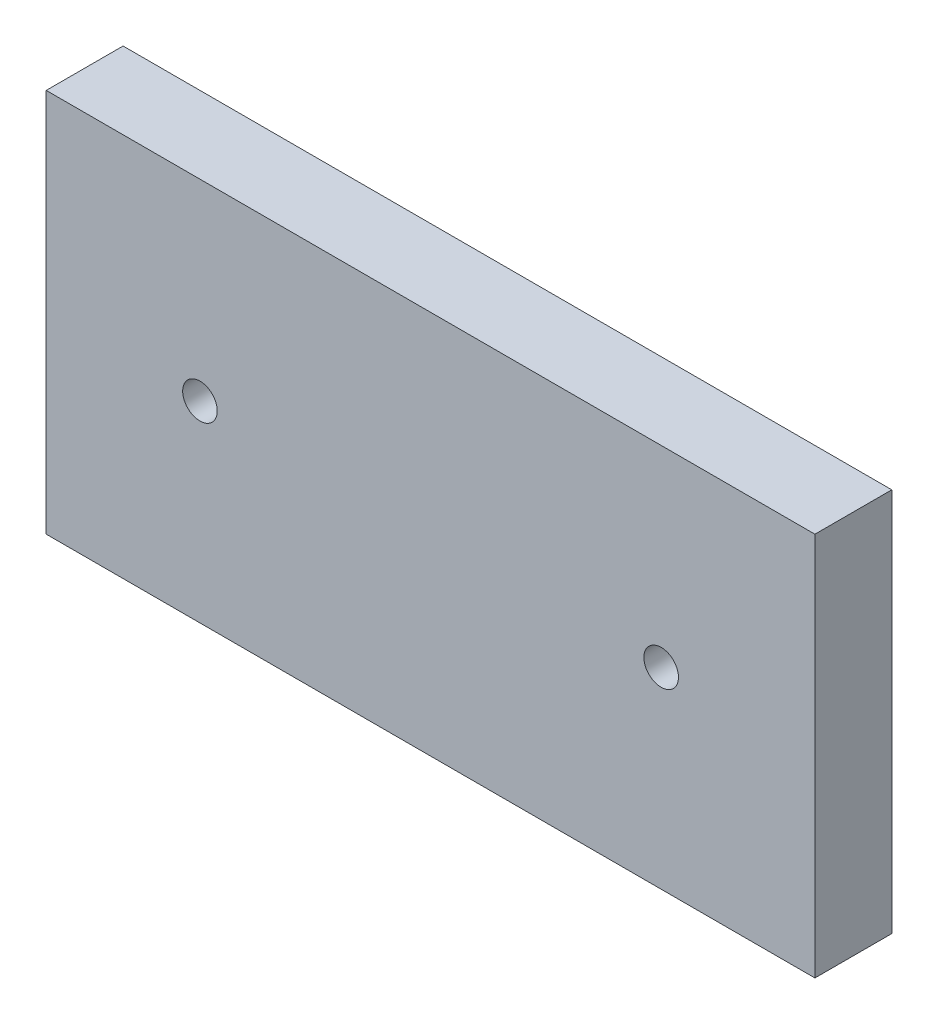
from build123d import *

# Parameters (mm, degrees)
ESQUISSE1_W             = 100
ESQUISSE1_H             = 50
BOSS_EXTRU_1_DEPTH      = 10
ESQUISSE2_R             = 2.25
ENL_V_MAT_EXTRU_1_DEPTH = 57.789083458


with BuildPart() as part:
    # Esquisse1 → Boss.-Extru.1 (new body)
    with BuildSketch(Plane.XY):
        Rectangle(ESQUISSE1_W, ESQUISSE1_H)
    extrude(amount=BOSS_EXTRU_1_DEPTH)

    # Esquisse2 → Enl_v. mat.-Extru.1 (cut, through all)
    with BuildSketch(Plane.XY.offset(10)):
        with Locations((-30, 0)):
            Circle(ESQUISSE2_R)
        with Locations((30, 0)):
            Circle(ESQUISSE2_R)
    extrude(amount=-ENL_V_MAT_EXTRU_1_DEPTH, mode=Mode.SUBTRACT)


solid = part.part
